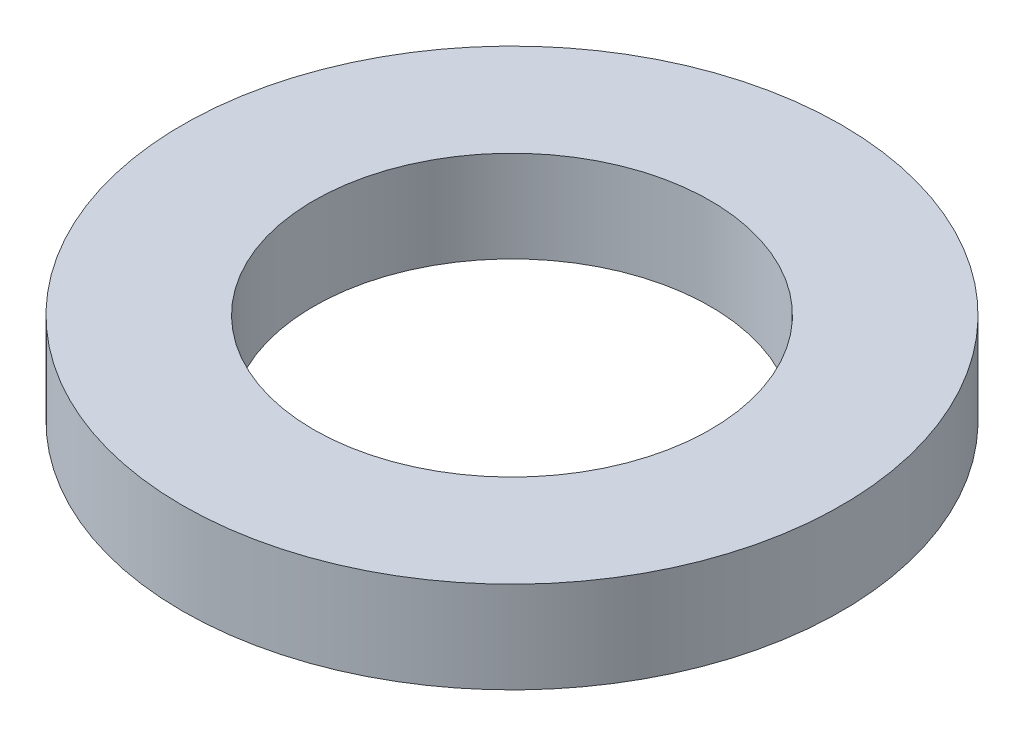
ISO-10303-21;
HEADER;
FILE_DESCRIPTION(('STEP AP214'),'2;1');
FILE_NAME('part.step','',(''),(''),'','','');
FILE_SCHEMA(('AUTOMOTIVE_DESIGN { 1 0 10303 214 1 1 1 1 }'));
ENDSEC;
DATA;
#1=APPLICATION_CONTEXT('core data for automotive mechanical design processes');
#2=APPLICATION_PROTOCOL_DEFINITION('international standard','automotive_design',2000,#1);
#3=PRODUCT_CONTEXT('',#1,'mechanical');
#4=PRODUCT('Part','Part','',(#3));
#5=PRODUCT_RELATED_PRODUCT_CATEGORY('part','',(#4));
#6=PRODUCT_DEFINITION_FORMATION('','',#4);
#7=PRODUCT_DEFINITION_CONTEXT('part definition',#1,'design');
#8=PRODUCT_DEFINITION('design','',#6,#7);
#9=PRODUCT_DEFINITION_SHAPE('','',#8);
#10=(LENGTH_UNIT() NAMED_UNIT(*) SI_UNIT(.MILLI.,.METRE.));
#11=(NAMED_UNIT(*) PLANE_ANGLE_UNIT() SI_UNIT($,.RADIAN.));
#12=(NAMED_UNIT(*) SI_UNIT($,.STERADIAN.) SOLID_ANGLE_UNIT());
#13=UNCERTAINTY_MEASURE_WITH_UNIT(LENGTH_MEASURE(1.E-05),#10,'distance_accuracy_value','');
#14=(GEOMETRIC_REPRESENTATION_CONTEXT(3) GLOBAL_UNCERTAINTY_ASSIGNED_CONTEXT((#13)) GLOBAL_UNIT_ASSIGNED_CONTEXT((#10,
#11,#12)) REPRESENTATION_CONTEXT('',''));
#15=CARTESIAN_POINT('',(0.,0.,0.));
#16=DIRECTION('',(0.,0.,1.));
#17=DIRECTION('',(1.,0.,0.));
#18=AXIS2_PLACEMENT_3D('',#15,#16,#17);
#19=CARTESIAN_POINT('',(0.,1.5,0.));
#20=DIRECTION('',(0.,1.,0.));
#21=DIRECTION('',(0.,0.,1.));
#22=AXIS2_PLACEMENT_3D('',#19,#20,#21);
#23=PLANE('',#22);
#24=CARTESIAN_POINT('',(0.,1.5,0.));
#25=DIRECTION('',(0.,1.,0.));
#26=DIRECTION('',(0.,0.,1.));
#27=AXIS2_PLACEMENT_3D('',#24,#25,#26);
#28=CIRCLE('',#27,5.4);
#29=CARTESIAN_POINT('',(0.,1.5,5.4));
#30=VERTEX_POINT('',#29);
#31=EDGE_CURVE('E10',#30,#30,#28,.T.);
#32=ORIENTED_EDGE('',*,*,#31,.T.);
#33=EDGE_LOOP('',(#32));
#34=FACE_BOUND('',#33,.T.);
#35=CARTESIAN_POINT('',(0.,1.5,0.));
#36=DIRECTION('',(0.,1.,0.));
#37=DIRECTION('',(0.,0.,1.));
#38=AXIS2_PLACEMENT_3D('',#35,#36,#37);
#39=CIRCLE('',#38,3.25);
#40=CARTESIAN_POINT('',(0.,1.5,3.25));
#41=VERTEX_POINT('',#40);
#42=EDGE_CURVE('E48',#41,#41,#39,.T.);
#43=ORIENTED_EDGE('',*,*,#42,.F.);
#44=EDGE_LOOP('',(#43));
#45=FACE_BOUND('',#44,.T.);
#46=ADVANCED_FACE('F37',(#34,#45),#23,.T.);
#47=CARTESIAN_POINT('',(0.,0.,0.));
#48=DIRECTION('',(0.,1.,0.));
#49=DIRECTION('',(0.,0.,1.));
#50=AXIS2_PLACEMENT_3D('',#47,#48,#49);
#51=PLANE('',#50);
#52=CARTESIAN_POINT('',(0.,0.,0.));
#53=DIRECTION('',(0.,1.,0.));
#54=DIRECTION('',(0.,0.,1.));
#55=AXIS2_PLACEMENT_3D('',#52,#53,#54);
#56=CIRCLE('',#55,5.4);
#57=CARTESIAN_POINT('',(0.,0.,5.4));
#58=VERTEX_POINT('',#57);
#59=EDGE_CURVE('E41',#58,#58,#56,.T.);
#60=ORIENTED_EDGE('',*,*,#59,.F.);
#61=EDGE_LOOP('',(#60));
#62=FACE_BOUND('',#61,.T.);
#63=CARTESIAN_POINT('',(0.,0.,0.));
#64=DIRECTION('',(0.,1.,0.));
#65=DIRECTION('',(0.,0.,1.));
#66=AXIS2_PLACEMENT_3D('',#63,#64,#65);
#67=CIRCLE('',#66,3.25);
#68=CARTESIAN_POINT('',(0.,0.,3.25));
#69=VERTEX_POINT('',#68);
#70=EDGE_CURVE('E50',#69,#69,#67,.T.);
#71=ORIENTED_EDGE('',*,*,#70,.T.);
#72=EDGE_LOOP('',(#71));
#73=FACE_BOUND('',#72,.T.);
#74=ADVANCED_FACE('F60',(#62,#73),#51,.F.);
#75=CARTESIAN_POINT('',(0.,1.5,0.));
#76=DIRECTION('',(0.,-1.,0.));
#77=DIRECTION('',(0.,0.,-1.));
#78=AXIS2_PLACEMENT_3D('',#75,#76,#77);
#79=CYLINDRICAL_SURFACE('',#78,5.4);
#80=ORIENTED_EDGE('',*,*,#31,.F.);
#81=EDGE_LOOP('',(#80));
#82=FACE_BOUND('',#81,.T.);
#83=ORIENTED_EDGE('',*,*,#59,.T.);
#84=EDGE_LOOP('',(#83));
#85=FACE_BOUND('',#84,.T.);
#86=ADVANCED_FACE('F39',(#82,#85),#79,.T.);
#87=CARTESIAN_POINT('',(0.,1.5,0.));
#88=DIRECTION('',(0.,-1.,0.));
#89=DIRECTION('',(0.,0.,-1.));
#90=AXIS2_PLACEMENT_3D('',#87,#88,#89);
#91=CYLINDRICAL_SURFACE('',#90,3.25);
#92=ORIENTED_EDGE('',*,*,#42,.T.);
#93=EDGE_LOOP('',(#92));
#94=FACE_BOUND('',#93,.T.);
#95=ORIENTED_EDGE('',*,*,#70,.F.);
#96=EDGE_LOOP('',(#95));
#97=FACE_BOUND('',#96,.T.);
#98=ADVANCED_FACE('F56',(#94,#97),#91,.F.);
#99=CLOSED_SHELL('',(#46,#74,#86,#98));
#100=MANIFOLD_SOLID_BREP('B2',#99);
#101=ADVANCED_BREP_SHAPE_REPRESENTATION('',(#18,#100),#14);
#102=SHAPE_DEFINITION_REPRESENTATION(#9,#101);
ENDSEC;
END-ISO-10303-21;
